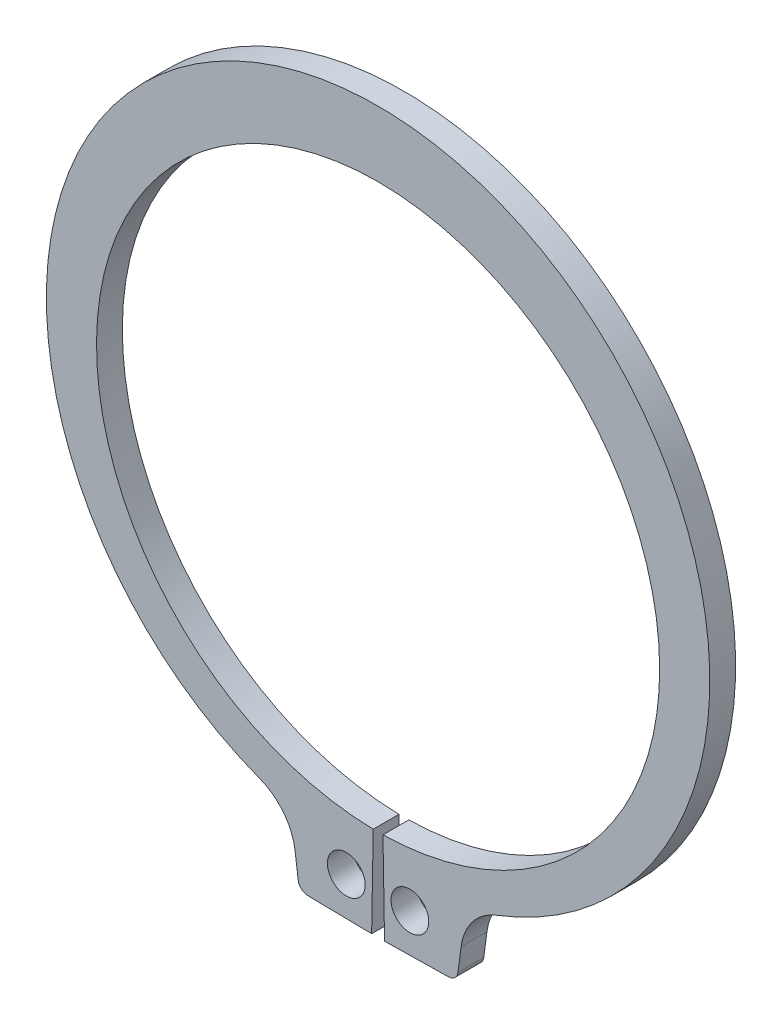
from build123d import *

# Parameters (mm, degrees)
BODYSKE_R  = 0.95
BODY_DEPTH = 1.3


with BuildPart() as part:
    # BodySke → Body (new body)
    with BuildSketch(Plane.XY):
        with BuildLine():
            Line((0.245372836, -14.172876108), (0.325, -18.772186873))
            Line((0.325, -18.772186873), (3.534275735, -18.716625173))
            ThreePointArc((3.534275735, -18.716625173), (3.858534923, -18.589752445), (4.021343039, -18.281963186))
            Line((4.021343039, -18.281963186), (4.180453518, -17.073399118))
            ThreePointArc((4.180453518, -17.073399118), (4.759033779, -15.703688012), (5.9573527, -14.82340658))
            ThreePointArc((5.9573527, -14.82340658), (0, 17.475), (-5.9573527, -14.82340658))
            ThreePointArc((-5.9573527, -14.82340658), (-4.759033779, -15.703688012), (-4.180453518, -17.073399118))
            Line((-4.180453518, -17.073399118), (-4.021343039, -18.281963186))
            ThreePointArc((-4.021343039, -18.281963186), (-3.858534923, -18.589752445), (-3.534275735, -18.716625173))
            Line((-3.534275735, -18.716625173), (-0.325, -18.772186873))
            Line((-0.325, -18.772186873), (-0.245372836, -14.172876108))
            ThreePointArc((-0.245372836, -14.172876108), (0, 14.175), (0.245372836, -14.172876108))
        make_face()
        with Locations((1.6, -16.811533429)):
            Circle(BODYSKE_R, mode=Mode.SUBTRACT)
        with Locations((-1.6, -16.811533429)):
            Circle(BODYSKE_R, mode=Mode.SUBTRACT)
    extrude(amount=-BODY_DEPTH)


solid = part.part
